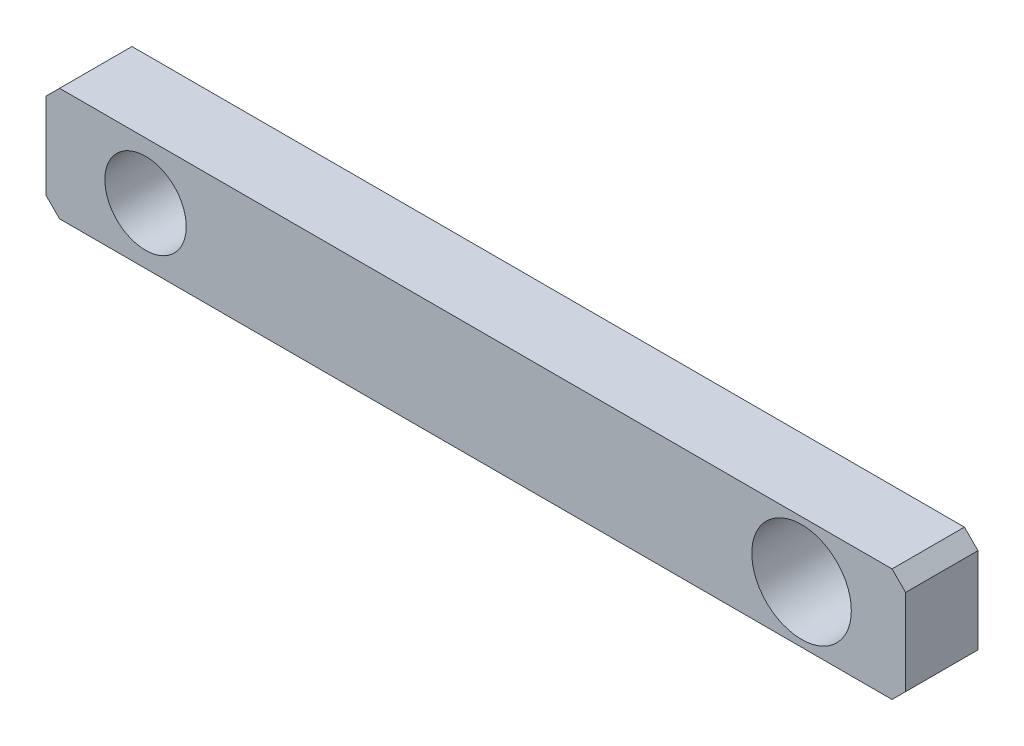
from build123d import *

# Parameters (mm, degrees)
ESQUISSE1_W             = 190
ESQUISSE1_H             = 25
BASE_EXTRUSION_DEPTH    = 16
CHANFREIN1_SIZE         = 3
ESQUISSE2_R             = 9
ESQUISSE2_R_2           = 11
ENL_V_MAT_EXTRU_1_DEPTH = 30


with BuildPart() as part:
    # Esquisse1 → Base-Extrusion (new body)
    with BuildSketch(Plane.XY):
        with Locations((-55.527977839, -9.329224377)):
            Rectangle(ESQUISSE1_W, ESQUISSE1_H)
    extrude(amount=BASE_EXTRUSION_DEPTH)

    # Chanfrein1
    chanfrein1_edges = [part.edges().sort_by_distance(p)[0] for p in [
        (-150.527977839, 3.170775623, 8),
        (39.472022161, 3.170775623, 8),
        (39.472022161, -21.829224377, 8),
        (-150.527977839, -21.829224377, 8),
    ]]
    chamfer(chanfrein1_edges, length=CHANFREIN1_SIZE)

    # Esquisse2 → Enl_v. mat.-Extru.1 (cut)
    with BuildSketch(Plane.XY.offset(16)):
        with Locations((-128.527977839, -9.329224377)):
            Circle(ESQUISSE2_R)
        with Locations((16.472022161, -9.329224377)):
            Circle(ESQUISSE2_R_2)
    extrude(amount=-ENL_V_MAT_EXTRU_1_DEPTH, mode=Mode.SUBTRACT)


solid = part.part
